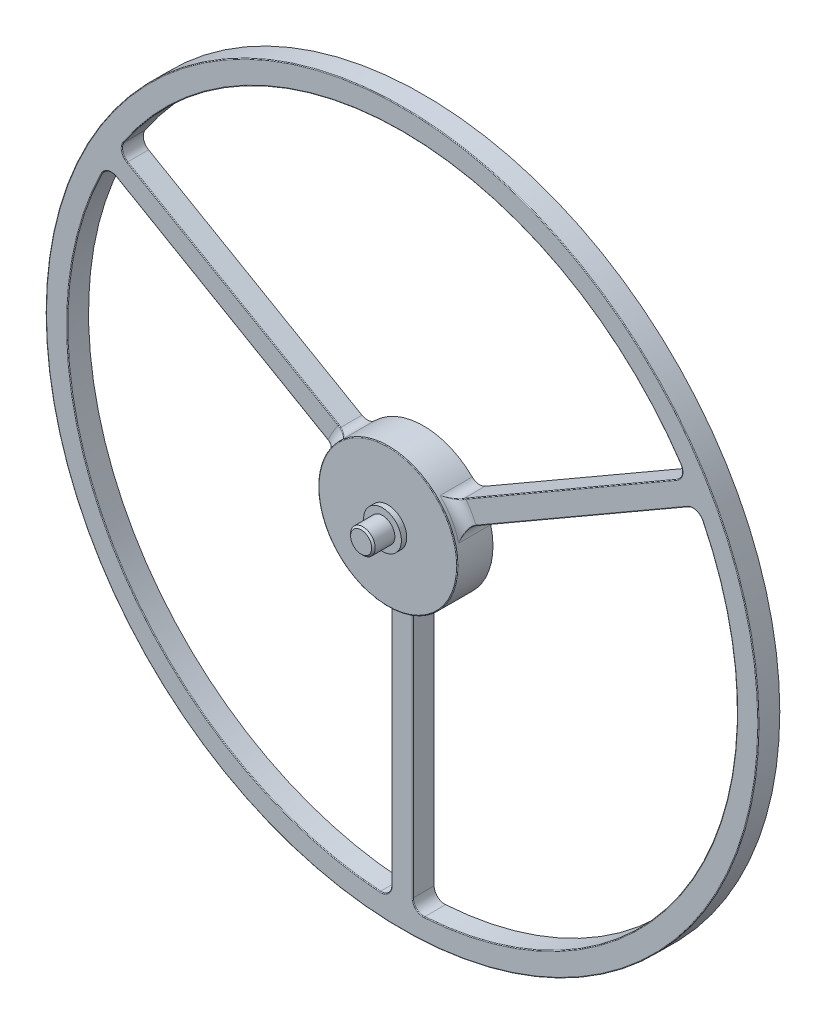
from build123d import *

# Parameters (mm, degrees)
CROQUIS2_R              = 19.5
SALIENTE_EXTRUIR1_DEPTH = 10
CROQUIS3_R              = 100
SALIENTE_EXTRUIR2_DEPTH = 6
REDONDEO1_R             = 3
CROQUIS4_R              = 5.3
SALIENTE_EXTRUIR3_DEPTH = 1.5
CROQUIS5_R              = 3.46
SALIENTE_EXTRUIR4_DEPTH = 6
CHAFL_N1_SIZE           = 0.5
REDONDEO2_R             = 0.2


with BuildPart() as part:
    # Croquis2 → Saliente-Extruir1 (new body)
    with BuildSketch(Plane.XY):
        Circle(CROQUIS2_R)
    extrude(amount=SALIENTE_EXTRUIR1_DEPTH)

    # Croquis3 → Saliente-Extruir2 (add)
    with BuildSketch(Plane.XY):
        Circle(CROQUIS3_R)
        with BuildLine():
            Line((-3, -19.267848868), (-3, -93.952115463))
            ThreePointArc((-3, -93.952115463), (-81.406387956, -47), (-82.86491873, 44.37798152))
            Line((-82.86491873, 44.37798152), (-18.186446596, 7.035848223))
            ThreePointArc((-18.186446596, 7.035848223), (-16.887495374, 9.75), (-15.186446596, 12.232000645))
            Line((-15.186446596, 12.232000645), (-79.86491873, 49.574133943))
            ThreePointArc((-79.86491873, 49.574133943), (0, 94), (79.86491873, 49.574133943))
            Line((79.86491873, 49.574133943), (15.186446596, 12.232000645))
            ThreePointArc((15.186446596, 12.232000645), (16.887495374, 9.75), (18.186446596, 7.035848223))
            Line((18.186446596, 7.035848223), (82.86491873, 44.37798152))
            ThreePointArc((82.86491873, 44.37798152), (81.406387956, -47), (3, -93.952115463))
            Line((3, -93.952115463), (3, -19.267848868))
            ThreePointArc((3, -19.267848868), (0, -19.5), (-3, -19.267848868))
        make_face(mode=Mode.SUBTRACT)
    extrude(amount=SALIENTE_EXTRUIR2_DEPTH)

    # Redondeo1
    redondeo1_edges = [part.edges().sort_by_distance(p)[0] for p in [
        (0, -19.5, 6),
        (3, -19.267848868, 3),
        (3, -93.952115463, 3),
        (82.86491873, 44.37798152, 3),
        (18.186446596, 7.035848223, 3),
        (16.887495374, 9.75, 6),
        (15.186446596, 12.232000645, 3),
        (79.86491873, 49.574133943, 3),
        (-79.86491873, 49.574133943, 3),
        (-15.186446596, 12.232000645, 3),
        (-16.887495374, 9.75, 6),
        (-18.186446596, 7.035848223, 3),
        (-82.86491873, 44.37798152, 3),
        (-3, -93.952115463, 3),
        (-3, -19.267848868, 3),
    ]]
    fillet(redondeo1_edges, radius=REDONDEO1_R)

    # Croquis4 → Saliente-Extruir3 (add)
    with BuildSketch(Plane.XY.offset(10)):
        Circle(CROQUIS4_R)
    extrude(amount=SALIENTE_EXTRUIR3_DEPTH)

    # Croquis5 → Saliente-Extruir4 (add)
    with BuildSketch(Plane.XY.offset(11.5)):
        Circle(CROQUIS5_R)
    extrude(amount=SALIENTE_EXTRUIR4_DEPTH)

    # Chafl_n1
    chafl_n1_edges = [part.edges().sort_by_distance(p)[0] for p in [
        (-3.46, 0, 17.5),
    ]]
    chamfer(chafl_n1_edges, length=CHAFL_N1_SIZE)

    # Redondeo2
    redondeo2_edges = [part.edges().sort_by_distance(p)[0] for p in [
        (-19.5, 0, 10),
        (18.942443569, 6.620334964, 7.246226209),
        (20.544417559, 8.397223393, 6.015617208),
        (15.204600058, 13.094469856, 7.246226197),
        (17.54441756, 13.593375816, 6.015617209),
        (-15.204600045, 13.094469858, 7.246226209),
        (3.737843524, -19.714804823, 7.246226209),
        (-17.544417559, 13.593375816, 6.015617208),
        (-18.94244357, 6.620334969, 7.246226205),
        (-20.54441756, 8.397223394, 6.015617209),
        (3, -21.99059921, 6.015617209),
        (-3.737843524, -19.714804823, 7.246226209),
        (-3, -21.990599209, 6.015617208),
        (50.47420661, 25.677195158, 6),
        (82.508441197, 43.075427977, 6),
        (3, -56.550542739, 6),
        (81.406387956, -47, 6),
        (3.949805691, -92.992120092, 6),
        (-100, 0, 6),
        (47.47420661, 30.873347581, 6),
        (-47.47420661, 30.873347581, 6),
        (78.558635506, 49.916692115, 6),
        (-78.558635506, 49.916692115, 6),
        (0, 94, 6),
        (-50.47420661, 25.677195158, 6),
        (-3, -56.550542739, 6),
        (-82.508441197, 43.075427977, 6),
        (-3.949805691, -92.992120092, 6),
        (-81.406387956, -47, 6),
    ]]
    fillet(redondeo2_edges, radius=REDONDEO2_R)


solid = part.part
